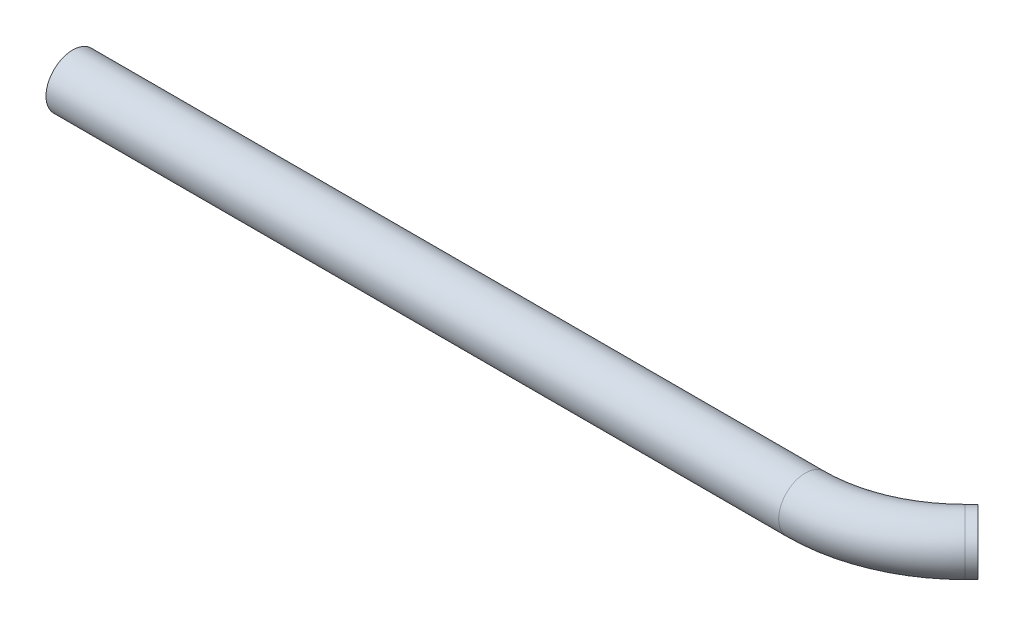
ISO-10303-21;
HEADER;
FILE_DESCRIPTION(('STEP AP214'),'2;1');
FILE_NAME('part.step','',(''),(''),'','','');
FILE_SCHEMA(('AUTOMOTIVE_DESIGN { 1 0 10303 214 1 1 1 1 }'));
ENDSEC;
DATA;
#1=APPLICATION_CONTEXT('core data for automotive mechanical design processes');
#2=APPLICATION_PROTOCOL_DEFINITION('international standard','automotive_design',2000,#1);
#3=PRODUCT_CONTEXT('',#1,'mechanical');
#4=PRODUCT('Part','Part','',(#3));
#5=PRODUCT_RELATED_PRODUCT_CATEGORY('part','',(#4));
#6=PRODUCT_DEFINITION_FORMATION('','',#4);
#7=PRODUCT_DEFINITION_CONTEXT('part definition',#1,'design');
#8=PRODUCT_DEFINITION('design','',#6,#7);
#9=PRODUCT_DEFINITION_SHAPE('','',#8);
#10=(LENGTH_UNIT() NAMED_UNIT(*) SI_UNIT(.MILLI.,.METRE.));
#11=(NAMED_UNIT(*) PLANE_ANGLE_UNIT() SI_UNIT($,.RADIAN.));
#12=(NAMED_UNIT(*) SI_UNIT($,.STERADIAN.) SOLID_ANGLE_UNIT());
#13=UNCERTAINTY_MEASURE_WITH_UNIT(LENGTH_MEASURE(1.E-05),#10,'distance_accuracy_value','');
#14=(GEOMETRIC_REPRESENTATION_CONTEXT(3) GLOBAL_UNCERTAINTY_ASSIGNED_CONTEXT((#13)) GLOBAL_UNIT_ASSIGNED_CONTEXT((#10,
#11,#12)) REPRESENTATION_CONTEXT('',''));
#15=CARTESIAN_POINT('',(0.,0.,0.));
#16=DIRECTION('',(0.,0.,1.));
#17=DIRECTION('',(1.,0.,0.));
#18=AXIS2_PLACEMENT_3D('',#15,#16,#17);
#19=CARTESIAN_POINT('',(25.2074039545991,0.,-1.39490395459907));
#20=DIRECTION('',(0.707106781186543,0.,-0.707106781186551));
#21=DIRECTION('',(-0.707106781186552,0.,-0.707106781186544));
#22=AXIS2_PLACEMENT_3D('',#19,#20,#21);
#23=CYLINDRICAL_SURFACE('',#22,0.79375);
#24=CARTESIAN_POINT('',(25.2074039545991,0.,-1.39490395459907));
#25=DIRECTION('',(0.707106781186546,0.,-0.707106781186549));
#26=DIRECTION('',(-0.707106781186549,0.,-0.707106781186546));
#27=AXIS2_PLACEMENT_3D('',#24,#25,#26);
#28=CIRCLE('',#27,0.79375);
#29=CARTESIAN_POINT('',(25.7686699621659,0.,-0.833637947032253));
#30=VERTEX_POINT('',#29);
#31=EDGE_CURVE('E36',#30,#30,#28,.T.);
#32=ORIENTED_EDGE('',*,*,#31,.T.);
#33=EDGE_LOOP('',(#32));
#34=FACE_BOUND('',#33,.T.);
#35=CARTESIAN_POINT('',(25.4,0.,-1.5875));
#36=DIRECTION('',(0.707106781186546,0.,-0.707106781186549));
#37=DIRECTION('',(-0.707106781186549,0.,-0.707106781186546));
#38=AXIS2_PLACEMENT_3D('',#35,#36,#37);
#39=CIRCLE('',#38,0.79375);
#40=CARTESIAN_POINT('',(24.8387339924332,0.,-2.14876600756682));
#41=VERTEX_POINT('',#40);
#42=EDGE_CURVE('E10',#41,#41,#39,.T.);
#43=ORIENTED_EDGE('',*,*,#42,.F.);
#44=EDGE_LOOP('',(#43));
#45=FACE_BOUND('',#44,.T.);
#46=ADVANCED_FACE('F30',(#34,#45),#23,.T.);
#47=CARTESIAN_POINT('',(21.8398079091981,0.,-4.7625));
#48=DIRECTION('',(0.,1.,0.));
#49=DIRECTION('',(0.,0.,1.));
#50=AXIS2_PLACEMENT_3D('',#47,#48,#49);
#51=TOROIDAL_SURFACE('',#50,4.7625,0.79375);
#52=CARTESIAN_POINT('',(21.8398079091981,0.,0.));
#53=DIRECTION('',(1.,0.,0.));
#54=DIRECTION('',(0.,0.,-1.));
#55=AXIS2_PLACEMENT_3D('',#52,#53,#54);
#56=CIRCLE('',#55,0.79375);
#57=CARTESIAN_POINT('',(21.8398079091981,0.,0.79375));
#58=VERTEX_POINT('',#57);
#59=EDGE_CURVE('E40',#58,#58,#56,.T.);
#60=CARTESIAN_POINT('',(21.8398079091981,0.,-4.7625));
#61=DIRECTION('',(0.,1.,0.));
#62=DIRECTION('',(0.,0.,1.));
#63=AXIS2_PLACEMENT_3D('',#60,#61,#62);
#64=CIRCLE('',#63,5.55625);
#65=EDGE_CURVE('',#58,#30,#64,.T.);
#66=ORIENTED_EDGE('',*,*,#59,.T.);
#67=ORIENTED_EDGE('',*,*,#31,.F.);
#68=ORIENTED_EDGE('',*,*,#65,.T.);
#69=ORIENTED_EDGE('',*,*,#65,.F.);
#70=EDGE_LOOP('',(#66,#68,#67,#69));
#71=FACE_BOUND('',#70,.T.);
#72=ADVANCED_FACE('F62',(#71),#51,.T.);
#73=CARTESIAN_POINT('',(21.8398079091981,0.,0.));
#74=DIRECTION('',(-1.,0.,0.));
#75=DIRECTION('',(0.,0.,1.));
#76=AXIS2_PLACEMENT_3D('',#73,#74,#75);
#77=CYLINDRICAL_SURFACE('',#76,0.79375);
#78=ORIENTED_EDGE('',*,*,#59,.F.);
#79=EDGE_LOOP('',(#78));
#80=FACE_BOUND('',#79,.T.);
#81=CARTESIAN_POINT('',(0.,0.,0.));
#82=DIRECTION('',(1.,0.,0.));
#83=DIRECTION('',(0.,0.,-1.));
#84=AXIS2_PLACEMENT_3D('',#81,#82,#83);
#85=CIRCLE('',#84,0.79375);
#86=CARTESIAN_POINT('',(0.,0.,-0.79375));
#87=VERTEX_POINT('',#86);
#88=EDGE_CURVE('E44',#87,#87,#85,.T.);
#89=ORIENTED_EDGE('',*,*,#88,.T.);
#90=EDGE_LOOP('',(#89));
#91=FACE_BOUND('',#90,.T.);
#92=ADVANCED_FACE('F50',(#80,#91),#77,.T.);
#93=CARTESIAN_POINT('',(25.4,0.,-1.5875));
#94=DIRECTION('',(0.707106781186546,0.,-0.707106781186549));
#95=DIRECTION('',(-0.707106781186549,0.,-0.707106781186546));
#96=AXIS2_PLACEMENT_3D('',#93,#94,#95);
#97=PLANE('',#96);
#98=ORIENTED_EDGE('',*,*,#42,.T.);
#99=EDGE_LOOP('',(#98));
#100=FACE_BOUND('',#99,.T.);
#101=ADVANCED_FACE('F54',(#100),#97,.T.);
#102=CARTESIAN_POINT('',(0.,0.,0.));
#103=DIRECTION('',(1.,0.,0.));
#104=DIRECTION('',(0.,0.,-1.));
#105=AXIS2_PLACEMENT_3D('',#102,#103,#104);
#106=PLANE('',#105);
#107=ORIENTED_EDGE('',*,*,#88,.F.);
#108=EDGE_LOOP('',(#107));
#109=FACE_BOUND('',#108,.T.);
#110=ADVANCED_FACE('F52',(#109),#106,.F.);
#111=CLOSED_SHELL('',(#46,#72,#92,#101,#110));
#112=MANIFOLD_SOLID_BREP('B2',#111);
#113=ADVANCED_BREP_SHAPE_REPRESENTATION('',(#18,#112),#14);
#114=SHAPE_DEFINITION_REPRESENTATION(#9,#113);
ENDSEC;
END-ISO-10303-21;
